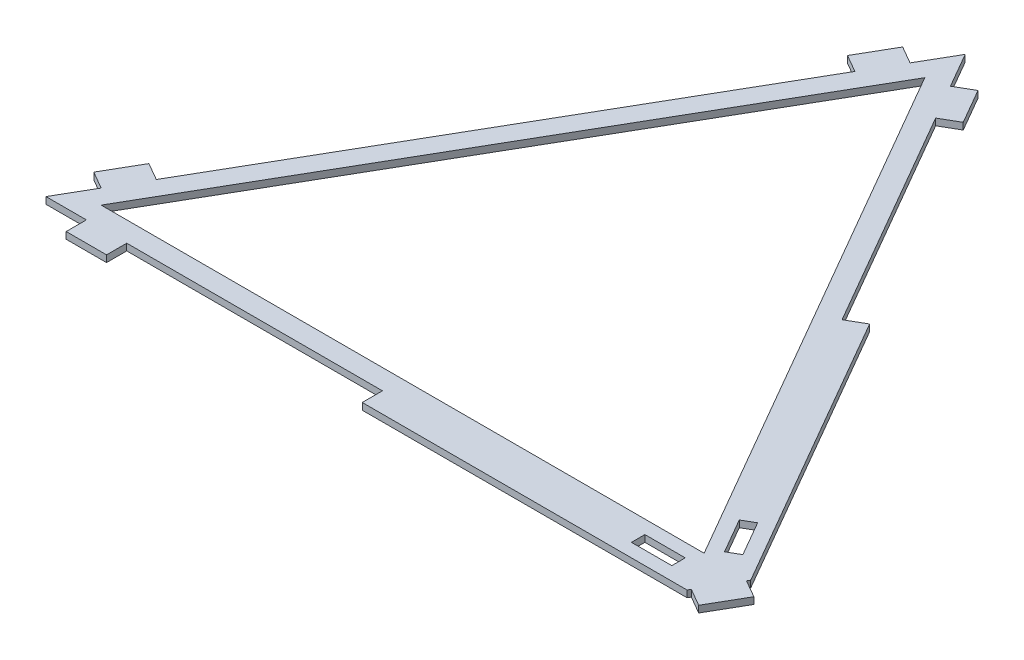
from build123d import *

# Parameters (mm, degrees)
CROQUIS1_W              = 30
CROQUIS1_H              = 10
SALIENTE_EXTRUIR1_DEPTH = 5


with BuildPart() as part:
    # Croquis1 → Saliente-Extruir1 (new body)
    with BuildSketch(Plane(origin=(0, 0, 0), x_dir=(1, 0, 0), z_dir=(0, 1, 0))):
        Polygon((30, 51.961524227), (220, 381.051177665), (207.009618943, 388.551177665), (222.009618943, 414.531939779), (235, 407.031939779), (250, 433.012701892), (265, 407.031939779), (277.990381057, 414.531939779), (292.990381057, 388.551177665), (280, 381.051177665), (375, 216.506350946), (387.990381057, 224.006350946), (508.660254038, 15), (507.5, 12.990381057), (520.490381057, 5.490381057), (505.490381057, -20.490381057), (492.5, -12.990381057), (491.339745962, -15), (250, -15), (250, 0), (60, 0), (60, -15), (30, -15), (30, 0), (0, 0), (15, 25.980762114), (2.009618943, 33.480762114), (17.009618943, 59.461524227), align=None)
        Polygon((25.980762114, 15), (474.019237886, 15), (250, 403.012701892), align=None, mode=Mode.SUBTRACT)
        with Locations((455, 0)):
            Rectangle(CROQUIS1_W, CROQUIS1_H, mode=Mode.SUBTRACT)
        Polygon((480.669872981, 23.480762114), (489.330127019, 28.480762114), (474.330127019, 54.461524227), (465.669872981, 49.461524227), align=None, mode=Mode.SUBTRACT)
    extrude(amount=SALIENTE_EXTRUIR1_DEPTH)


solid = part.part
